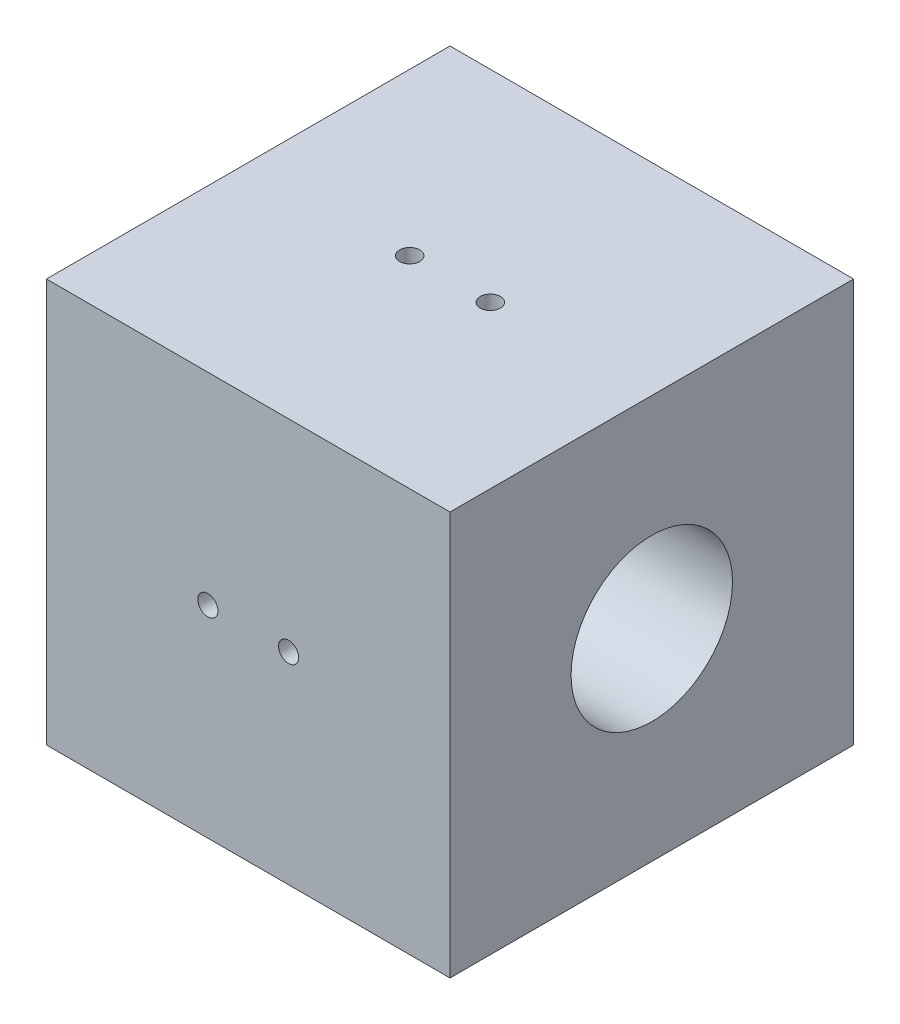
from build123d import *

# Parameters (mm, degrees)
SKETCH_THE_5_5_IN_SQUARE_W                     = 127
SKETCH_THE_5_5_IN_SQUARE_H                     = 127
BOSS_EXTRUDE_THE_SQUARE_TO_MAKE_CUBE_BOX_DEPTH = 127
SKETCH_TWO_CIRCLES_ON_THE_TOP_SIDE_R           = 3.175
CUT_EXTRUDE_SMALL_CIRCLES_TO_MAKE_HOLES_DEPTH  = 48
SKETCH_TWO_CIRCLES_TO_MAKE_HOLES_FOR_ZIP_R     = 3.175
CUT_EXTRUDE_SMALL_CIRCLES_ONLY_TO_THE_MI_DEPTH = 48
SKETCH_CIRCLES_ON_THE_SIDE_VIEWS_R             = 25.4
CUT_EXTRUDE_CIRCLE_ON_THE_SIDE_VIEWA_DEPTH     = 191.5


with BuildPart() as part:
    # Sketch the 5_5 in square → Boss-extrude the square to make cube box (new body)
    with BuildSketch(Plane.XY):
        Rectangle(SKETCH_THE_5_5_IN_SQUARE_W, SKETCH_THE_5_5_IN_SQUARE_H)
    extrude(amount=BOSS_EXTRUDE_THE_SQUARE_TO_MAKE_CUBE_BOX_DEPTH)

    # Sketch two circles on the top side → Cut-Extrude small circles to make holes (cut, symmetric)
    with BuildSketch(Plane(origin=(0, 63.5, 0), x_dir=(1, 0, 0), z_dir=(0, 1, 0))):
        with Locations(Location((-12.7, -63.5, 0), (0, 0, 270))):
            Circle(SKETCH_TWO_CIRCLES_ON_THE_TOP_SIDE_R)
        with Locations(Location((12.7, -63.5, 0), (0, 0, 270))):
            Circle(SKETCH_TWO_CIRCLES_ON_THE_TOP_SIDE_R)
    extrude(amount=CUT_EXTRUDE_SMALL_CIRCLES_TO_MAKE_HOLES_DEPTH, both=True, mode=Mode.SUBTRACT)

    # Sketch two circles to make holes for zip → Cut-Extrude small circles only to the mi (cut, symmetric)
    with BuildSketch(Plane.XY.offset(127)):
        with Locations((-12.7, 0)):
            Circle(SKETCH_TWO_CIRCLES_TO_MAKE_HOLES_FOR_ZIP_R)
        with Locations((12.7, 0)):
            Circle(SKETCH_TWO_CIRCLES_TO_MAKE_HOLES_FOR_ZIP_R)
    extrude(amount=CUT_EXTRUDE_SMALL_CIRCLES_ONLY_TO_THE_MI_DEPTH, both=True, mode=Mode.SUBTRACT)

    # Sketch circles on the side views → Cut-Extrude circle on the side viewa (cut, through all)
    with BuildSketch(Plane.ZY.offset(63.5)):
        with Locations((63.5, 0)):
            Circle(SKETCH_CIRCLES_ON_THE_SIDE_VIEWS_R)
    extrude(amount=-CUT_EXTRUDE_CIRCLE_ON_THE_SIDE_VIEWA_DEPTH, mode=Mode.SUBTRACT)


solid = part.part
